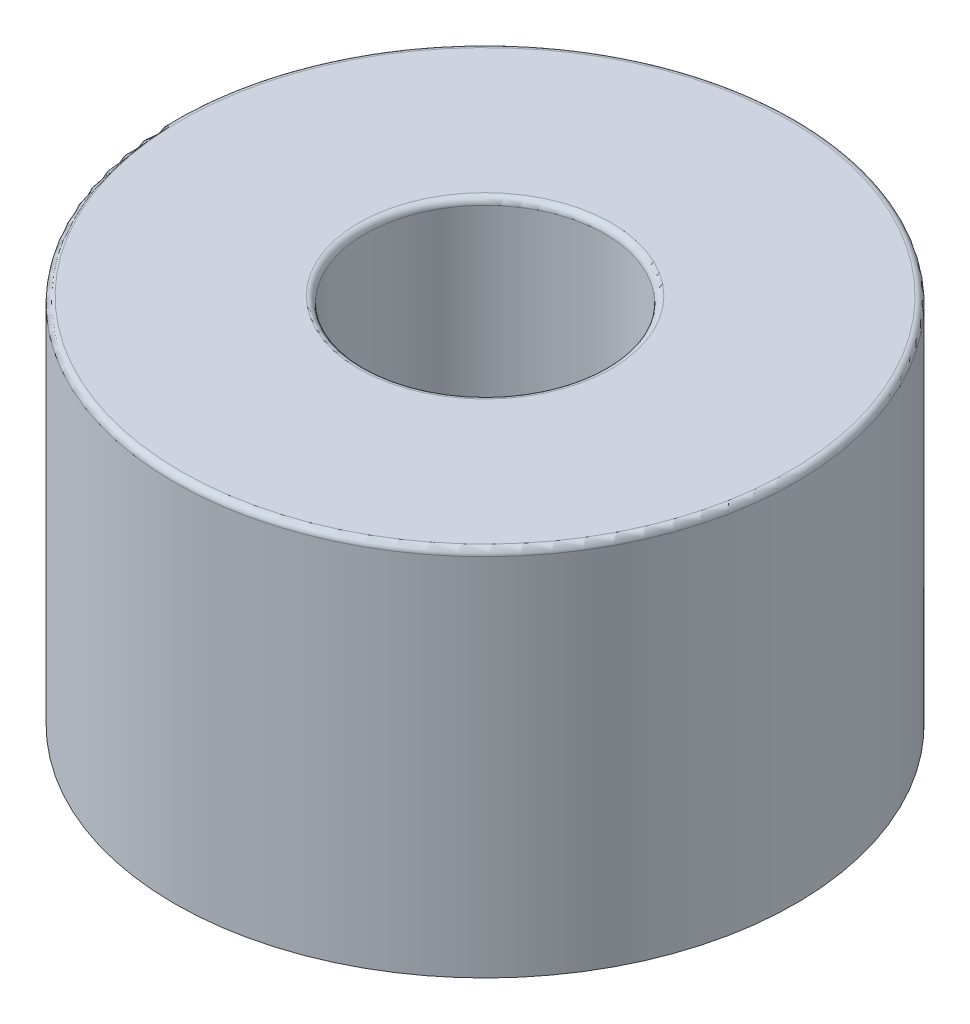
from build123d import *

# Parameters (mm, degrees)
SKETCH1_R           = 12.319
SKETCH1_R_2         = 4.7625
BOSS_EXTRUDE1_DEPTH = 14.732
FILLET1_R           = 0.254


with BuildPart() as part:
    # Sketch1 → Boss-Extrude1 (new body)
    with BuildSketch(Plane(origin=(0, 0, 0), x_dir=(1, 0, 0), z_dir=(0, 1, 0))):
        with Locations(Location((0, 0, 0), (0, 0, 270))):
            Circle(SKETCH1_R)
        with Locations(Location((0, 0, 0), (0, 0, 270))):
            Circle(SKETCH1_R_2, mode=Mode.SUBTRACT)
    extrude(amount=BOSS_EXTRUDE1_DEPTH)

    # Fillet1
    fillet1_edges = [part.edges().sort_by_distance(p)[0] for p in [
        (0, 14.732, -12.319),
        (0, 14.732, -4.7625),
    ]]
    fillet(fillet1_edges, radius=FILLET1_R)


solid = part.part
